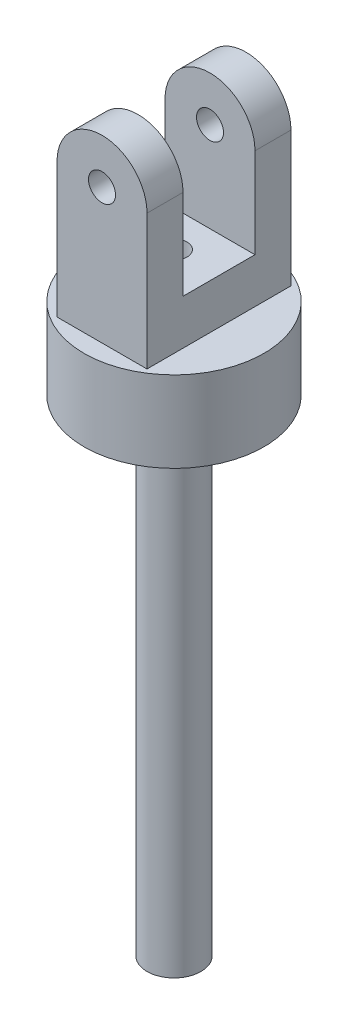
ISO-10303-21;
HEADER;
FILE_DESCRIPTION(('STEP AP214'),'2;1');
FILE_NAME('part.step','',(''),(''),'','','');
FILE_SCHEMA(('AUTOMOTIVE_DESIGN { 1 0 10303 214 1 1 1 1 }'));
ENDSEC;
DATA;
#1=APPLICATION_CONTEXT('core data for automotive mechanical design processes');
#2=APPLICATION_PROTOCOL_DEFINITION('international standard','automotive_design',2000,#1);
#3=PRODUCT_CONTEXT('',#1,'mechanical');
#4=PRODUCT('Part','Part','',(#3));
#5=PRODUCT_RELATED_PRODUCT_CATEGORY('part','',(#4));
#6=PRODUCT_DEFINITION_FORMATION('','',#4);
#7=PRODUCT_DEFINITION_CONTEXT('part definition',#1,'design');
#8=PRODUCT_DEFINITION('design','',#6,#7);
#9=PRODUCT_DEFINITION_SHAPE('','',#8);
#10=(LENGTH_UNIT() NAMED_UNIT(*) SI_UNIT(.MILLI.,.METRE.));
#11=(NAMED_UNIT(*) PLANE_ANGLE_UNIT() SI_UNIT($,.RADIAN.));
#12=(NAMED_UNIT(*) SI_UNIT($,.STERADIAN.) SOLID_ANGLE_UNIT());
#13=UNCERTAINTY_MEASURE_WITH_UNIT(LENGTH_MEASURE(1.E-05),#10,'distance_accuracy_value','');
#14=(GEOMETRIC_REPRESENTATION_CONTEXT(3) GLOBAL_UNCERTAINTY_ASSIGNED_CONTEXT((#13)) GLOBAL_UNIT_ASSIGNED_CONTEXT((#10,
#11,#12)) REPRESENTATION_CONTEXT('',''));
#15=CARTESIAN_POINT('',(0.,0.,0.));
#16=DIRECTION('',(0.,0.,1.));
#17=DIRECTION('',(1.,0.,0.));
#18=AXIS2_PLACEMENT_3D('',#15,#16,#17);
#19=CARTESIAN_POINT('',(0.,-9.,0.));
#20=DIRECTION('',(0.,-1.,0.));
#21=DIRECTION('',(0.,0.,-1.));
#22=AXIS2_PLACEMENT_3D('',#19,#20,#21);
#23=PLANE('',#22);
#24=CARTESIAN_POINT('',(-10.6521739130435,-9.,1.73913043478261));
#25=DIRECTION('',(0.,-1.,0.));
#26=DIRECTION('',(0.,0.,-1.));
#27=AXIS2_PLACEMENT_3D('',#24,#25,#26);
#28=CIRCLE('',#27,8.);
#29=CARTESIAN_POINT('',(-10.6521739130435,-9.,-6.26086956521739));
#30=VERTEX_POINT('',#29);
#31=EDGE_CURVE('E289',#30,#30,#28,.F.);
#32=ORIENTED_EDGE('',*,*,#31,.F.);
#33=EDGE_LOOP('',(#32));
#34=FACE_BOUND('',#33,.T.);
#35=CARTESIAN_POINT('',(-10.6521739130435,-9.,1.73913043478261));
#36=DIRECTION('',(0.,-1.,0.));
#37=DIRECTION('',(0.,0.,-1.));
#38=AXIS2_PLACEMENT_3D('',#35,#36,#37);
#39=CIRCLE('',#38,3.);
#40=CARTESIAN_POINT('',(-10.6521739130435,-9.,-1.26086956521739));
#41=VERTEX_POINT('',#40);
#42=EDGE_CURVE('E159',#41,#41,#39,.F.);
#43=ORIENTED_EDGE('',*,*,#42,.T.);
#44=EDGE_LOOP('',(#43));
#45=FACE_BOUND('',#44,.T.);
#46=ADVANCED_FACE('F79',(#34,#45),#23,.T.);
#47=CARTESIAN_POINT('',(0.,-68.,0.));
#48=DIRECTION('',(0.,-1.,0.));
#49=DIRECTION('',(0.,0.,-1.));
#50=AXIS2_PLACEMENT_3D('',#47,#48,#49);
#51=PLANE('',#50);
#52=CARTESIAN_POINT('',(-10.6521739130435,-68.,1.73913043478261));
#53=DIRECTION('',(0.,-1.,0.));
#54=DIRECTION('',(0.,0.,-1.));
#55=AXIS2_PLACEMENT_3D('',#52,#53,#54);
#56=CIRCLE('',#55,1.45);
#57=CARTESIAN_POINT('',(-10.6521739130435,-68.,0.289130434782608));
#58=VERTEX_POINT('',#57);
#59=EDGE_CURVE('E302',#58,#58,#56,.T.);
#60=ORIENTED_EDGE('',*,*,#59,.F.);
#61=EDGE_LOOP('',(#60));
#62=FACE_BOUND('',#61,.T.);
#63=CARTESIAN_POINT('',(-10.6521739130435,-68.,1.73913043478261));
#64=DIRECTION('',(0.,-1.,0.));
#65=DIRECTION('',(0.,0.,-1.));
#66=AXIS2_PLACEMENT_3D('',#63,#64,#65);
#67=CIRCLE('',#66,3.);
#68=CARTESIAN_POINT('',(-10.6521739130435,-68.,-1.26086956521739));
#69=VERTEX_POINT('',#68);
#70=EDGE_CURVE('E180',#69,#69,#67,.T.);
#71=ORIENTED_EDGE('',*,*,#70,.T.);
#72=EDGE_LOOP('',(#71));
#73=FACE_BOUND('',#72,.T.);
#74=ADVANCED_FACE('F263',(#62,#73),#51,.T.);
#75=CARTESIAN_POINT('',(-10.6521739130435,-68.,1.73913043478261));
#76=DIRECTION('',(0.,1.,0.));
#77=DIRECTION('',(0.,0.,1.));
#78=AXIS2_PLACEMENT_3D('',#75,#76,#77);
#79=CYLINDRICAL_SURFACE('',#78,3.);
#80=ORIENTED_EDGE('',*,*,#42,.F.);
#81=EDGE_LOOP('',(#80));
#82=FACE_BOUND('',#81,.T.);
#83=ORIENTED_EDGE('',*,*,#70,.F.);
#84=EDGE_LOOP('',(#83));
#85=FACE_BOUND('',#84,.T.);
#86=ADVANCED_FACE('F269',(#82,#85),#79,.T.);
#87=CARTESIAN_POINT('',(-10.6521739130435,-14.,1.73913043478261));
#88=DIRECTION('',(0.,1.,0.));
#89=DIRECTION('',(0.,0.,1.));
#90=AXIS2_PLACEMENT_3D('',#87,#88,#89);
#91=CYLINDRICAL_SURFACE('',#90,8.);
#92=ORIENTED_EDGE('',*,*,#31,.T.);
#93=EDGE_LOOP('',(#92));
#94=FACE_BOUND('',#93,.T.);
#95=CARTESIAN_POINT('',(-10.6521739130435,-14.,1.73913043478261));
#96=DIRECTION('',(0.,-1.,0.));
#97=DIRECTION('',(0.,0.,-1.));
#98=AXIS2_PLACEMENT_3D('',#95,#96,#97);
#99=CIRCLE('',#98,8.);
#100=CARTESIAN_POINT('',(-10.6521739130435,-14.,-6.26086956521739));
#101=VERTEX_POINT('',#100);
#102=EDGE_CURVE('E297',#101,#101,#99,.T.);
#103=ORIENTED_EDGE('',*,*,#102,.T.);
#104=EDGE_LOOP('',(#103));
#105=FACE_BOUND('',#104,.T.);
#106=ADVANCED_FACE('F275',(#94,#105),#91,.F.);
#107=CARTESIAN_POINT('',(-10.6521739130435,-14.,1.73913043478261));
#108=DIRECTION('',(0.,1.,0.));
#109=DIRECTION('',(0.,0.,1.));
#110=AXIS2_PLACEMENT_3D('',#107,#108,#109);
#111=CYLINDRICAL_SURFACE('',#110,10.);
#112=CARTESIAN_POINT('',(-10.6521739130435,-14.,1.73913043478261));
#113=DIRECTION('',(0.,-1.,0.));
#114=DIRECTION('',(0.,0.,-1.));
#115=AXIS2_PLACEMENT_3D('',#112,#113,#114);
#116=CIRCLE('',#115,10.);
#117=CARTESIAN_POINT('',(-10.6521739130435,-14.,-8.26086956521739));
#118=VERTEX_POINT('',#117);
#119=EDGE_CURVE('E291',#118,#118,#116,.T.);
#120=ORIENTED_EDGE('',*,*,#119,.F.);
#121=EDGE_LOOP('',(#120));
#122=FACE_BOUND('',#121,.T.);
#123=CARTESIAN_POINT('',(-10.6521739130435,-5.,1.73913043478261));
#124=DIRECTION('',(0.,-1.,0.));
#125=DIRECTION('',(0.,0.,-1.));
#126=AXIS2_PLACEMENT_3D('',#123,#124,#125);
#127=CIRCLE('',#126,10.);
#128=CARTESIAN_POINT('',(-10.6521739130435,-5.,-8.26086956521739));
#129=VERTEX_POINT('',#128);
#130=EDGE_CURVE('E294',#129,#129,#127,.T.);
#131=ORIENTED_EDGE('',*,*,#130,.T.);
#132=EDGE_LOOP('',(#131));
#133=FACE_BOUND('',#132,.T.);
#134=ADVANCED_FACE('F282',(#122,#133),#111,.T.);
#135=CARTESIAN_POINT('',(0.,-14.,0.));
#136=DIRECTION('',(0.,-1.,0.));
#137=DIRECTION('',(0.,0.,-1.));
#138=AXIS2_PLACEMENT_3D('',#135,#136,#137);
#139=PLANE('',#138);
#140=ORIENTED_EDGE('',*,*,#102,.F.);
#141=EDGE_LOOP('',(#140));
#142=FACE_BOUND('',#141,.T.);
#143=ORIENTED_EDGE('',*,*,#119,.T.);
#144=EDGE_LOOP('',(#143));
#145=FACE_BOUND('',#144,.T.);
#146=ADVANCED_FACE('F334',(#142,#145),#139,.T.);
#147=CARTESIAN_POINT('',(-10.6521739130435,10.,-13.3319373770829));
#148=DIRECTION('',(0.,0.,1.));
#149=DIRECTION('',(1.,0.,0.));
#150=AXIS2_PLACEMENT_3D('',#147,#148,#149);
#151=CYLINDRICAL_SURFACE('',#150,1.5);
#152=CARTESIAN_POINT('',(-10.6521739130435,10.,-6.26086956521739));
#153=DIRECTION('',(0.,0.,-1.));
#154=DIRECTION('',(-1.,0.,0.));
#155=AXIS2_PLACEMENT_3D('',#152,#153,#154);
#156=CIRCLE('',#155,1.5);
#157=CARTESIAN_POINT('',(-12.1521739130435,10.,-6.26086956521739));
#158=VERTEX_POINT('',#157);
#159=EDGE_CURVE('E195',#158,#158,#156,.F.);
#160=ORIENTED_EDGE('',*,*,#159,.F.);
#161=EDGE_LOOP('',(#160));
#162=FACE_BOUND('',#161,.T.);
#163=CARTESIAN_POINT('',(-10.6521739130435,10.,-2.26086956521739));
#164=DIRECTION('',(0.,0.,-1.));
#165=DIRECTION('',(-1.,0.,0.));
#166=AXIS2_PLACEMENT_3D('',#163,#164,#165);
#167=CIRCLE('',#166,1.5);
#168=CARTESIAN_POINT('',(-12.1521739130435,10.,-2.26086956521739));
#169=VERTEX_POINT('',#168);
#170=EDGE_CURVE('E203',#169,#169,#167,.T.);
#171=ORIENTED_EDGE('',*,*,#170,.F.);
#172=EDGE_LOOP('',(#171));
#173=FACE_BOUND('',#172,.T.);
#174=ADVANCED_FACE('F331',(#162,#173),#151,.F.);
#175=CARTESIAN_POINT('',(-10.6521739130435,10.,5.73913043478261));
#176=DIRECTION('',(0.,0.,-1.));
#177=DIRECTION('',(-1.,0.,0.));
#178=AXIS2_PLACEMENT_3D('',#175,#176,#177);
#179=CIRCLE('',#178,1.5);
#180=CARTESIAN_POINT('',(-12.1521739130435,10.,5.73913043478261));
#181=VERTEX_POINT('',#180);
#182=EDGE_CURVE('E202',#181,#181,#179,.T.);
#183=ORIENTED_EDGE('',*,*,#182,.T.);
#184=EDGE_LOOP('',(#183));
#185=FACE_BOUND('',#184,.T.);
#186=CARTESIAN_POINT('',(-10.6521739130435,10.,9.73913043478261));
#187=DIRECTION('',(0.,0.,1.));
#188=DIRECTION('',(1.,0.,0.));
#189=AXIS2_PLACEMENT_3D('',#186,#187,#188);
#190=CIRCLE('',#189,1.5);
#191=CARTESIAN_POINT('',(-9.15217391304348,10.,9.73913043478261));
#192=VERTEX_POINT('',#191);
#193=EDGE_CURVE('E188',#192,#192,#190,.T.);
#194=ORIENTED_EDGE('',*,*,#193,.T.);
#195=EDGE_LOOP('',(#194));
#196=FACE_BOUND('',#195,.T.);
#197=ADVANCED_FACE('F228',(#185,#196),#151,.F.);
#198=CARTESIAN_POINT('',(0.,15.,-2.26086956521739));
#199=DIRECTION('',(0.,0.,-1.));
#200=DIRECTION('',(-1.,0.,0.));
#201=AXIS2_PLACEMENT_3D('',#198,#199,#200);
#202=PLANE('',#201);
#203=ORIENTED_EDGE('',*,*,#170,.T.);
#204=EDGE_LOOP('',(#203));
#205=FACE_BOUND('',#204,.T.);
#206=DIRECTION('',(0.,-1.,0.));
#207=VECTOR('',#206,1.);
#208=CARTESIAN_POINT('',(-5.65217391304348,15.,-2.26086956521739));
#209=LINE('',#208,#207);
#210=CARTESIAN_POINT('',(-5.65217391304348,10.,-2.26086956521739));
#211=VERTEX_POINT('',#210);
#212=CARTESIAN_POINT('',(-5.65217391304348,0.,-2.26086956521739));
#213=VERTEX_POINT('',#212);
#214=EDGE_CURVE('E218',#211,#213,#209,.T.);
#215=ORIENTED_EDGE('',*,*,#214,.F.);
#216=CARTESIAN_POINT('',(-10.6521739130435,10.,-2.26086956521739));
#217=DIRECTION('',(0.,0.,-1.));
#218=DIRECTION('',(-1.,0.,0.));
#219=AXIS2_PLACEMENT_3D('',#216,#217,#218);
#220=CIRCLE('',#219,5.);
#221=CARTESIAN_POINT('',(-15.6521739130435,10.,-2.26086956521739));
#222=VERTEX_POINT('',#221);
#223=EDGE_CURVE('E200',#222,#211,#220,.T.);
#224=ORIENTED_EDGE('',*,*,#223,.F.);
#225=DIRECTION('',(0.,-1.,0.));
#226=VECTOR('',#225,1.);
#227=CARTESIAN_POINT('',(-15.6521739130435,15.,-2.26086956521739));
#228=LINE('',#227,#226);
#229=CARTESIAN_POINT('',(-15.6521739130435,0.,-2.26086956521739));
#230=VERTEX_POINT('',#229);
#231=EDGE_CURVE('E220',#222,#230,#228,.T.);
#232=ORIENTED_EDGE('',*,*,#231,.T.);
#233=DIRECTION('',(1.,0.,0.));
#234=VECTOR('',#233,1.);
#235=CARTESIAN_POINT('',(0.,0.,-2.26086956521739));
#236=LINE('',#235,#234);
#237=EDGE_CURVE('E214',#230,#213,#236,.T.);
#238=ORIENTED_EDGE('',*,*,#237,.T.);
#239=EDGE_LOOP('',(#215,#224,#232,#238));
#240=FACE_BOUND('',#239,.T.);
#241=ADVANCED_FACE('F245',(#205,#240),#202,.F.);
#242=CARTESIAN_POINT('',(0.,0.,0.));
#243=DIRECTION('',(0.,1.,0.));
#244=DIRECTION('',(0.,0.,1.));
#245=AXIS2_PLACEMENT_3D('',#242,#243,#244);
#246=PLANE('',#245);
#247=CARTESIAN_POINT('',(-10.6521739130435,0.,1.73913043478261));
#248=DIRECTION('',(0.,1.,0.));
#249=DIRECTION('',(0.,0.,1.));
#250=AXIS2_PLACEMENT_3D('',#247,#248,#249);
#251=CIRCLE('',#250,1.45);
#252=CARTESIAN_POINT('',(-10.6521739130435,0.,3.18913043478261));
#253=VERTEX_POINT('',#252);
#254=EDGE_CURVE('E83',#253,#253,#251,.T.);
#255=ORIENTED_EDGE('',*,*,#254,.F.);
#256=EDGE_LOOP('',(#255));
#257=FACE_BOUND('',#256,.T.);
#258=DIRECTION('',(1.,0.,0.));
#259=VECTOR('',#258,1.);
#260=CARTESIAN_POINT('',(0.,0.,5.73913043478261));
#261=LINE('',#260,#259);
#262=CARTESIAN_POINT('',(-15.6521739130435,0.,5.73913043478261));
#263=VERTEX_POINT('',#262);
#264=CARTESIAN_POINT('',(-5.65217391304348,0.,5.73913043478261));
#265=VERTEX_POINT('',#264);
#266=EDGE_CURVE('E206',#263,#265,#261,.T.);
#267=ORIENTED_EDGE('',*,*,#266,.T.);
#268=DIRECTION('',(0.,0.,1.));
#269=VECTOR('',#268,1.);
#270=CARTESIAN_POINT('',(-5.65217391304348,0.,0.));
#271=LINE('',#270,#269);
#272=EDGE_CURVE('E167',#213,#265,#271,.T.);
#273=ORIENTED_EDGE('',*,*,#272,.F.);
#274=ORIENTED_EDGE('',*,*,#237,.F.);
#275=DIRECTION('',(0.,0.,1.));
#276=VECTOR('',#275,1.);
#277=CARTESIAN_POINT('',(-15.6521739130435,0.,0.));
#278=LINE('',#277,#276);
#279=EDGE_CURVE('E210',#230,#263,#278,.T.);
#280=ORIENTED_EDGE('',*,*,#279,.T.);
#281=EDGE_LOOP('',(#267,#273,#274,#280));
#282=FACE_BOUND('',#281,.T.);
#283=ADVANCED_FACE('F234',(#257,#282),#246,.T.);
#284=CARTESIAN_POINT('',(0.,15.,5.73913043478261));
#285=DIRECTION('',(0.,0.,-1.));
#286=DIRECTION('',(-1.,0.,0.));
#287=AXIS2_PLACEMENT_3D('',#284,#285,#286);
#288=PLANE('',#287);
#289=ORIENTED_EDGE('',*,*,#182,.F.);
#290=EDGE_LOOP('',(#289));
#291=FACE_BOUND('',#290,.T.);
#292=CARTESIAN_POINT('',(-10.6521739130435,10.,5.73913043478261));
#293=DIRECTION('',(0.,0.,-1.));
#294=DIRECTION('',(-1.,0.,0.));
#295=AXIS2_PLACEMENT_3D('',#292,#293,#294);
#296=CIRCLE('',#295,5.);
#297=CARTESIAN_POINT('',(-15.6521739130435,10.,5.73913043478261));
#298=VERTEX_POINT('',#297);
#299=CARTESIAN_POINT('',(-5.65217391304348,10.,5.73913043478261));
#300=VERTEX_POINT('',#299);
#301=EDGE_CURVE('E198',#298,#300,#296,.T.);
#302=ORIENTED_EDGE('',*,*,#301,.T.);
#303=DIRECTION('',(0.,-1.,0.));
#304=VECTOR('',#303,1.);
#305=CARTESIAN_POINT('',(-5.65217391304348,15.,5.73913043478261));
#306=LINE('',#305,#304);
#307=EDGE_CURVE('E95',#300,#265,#306,.T.);
#308=ORIENTED_EDGE('',*,*,#307,.T.);
#309=ORIENTED_EDGE('',*,*,#266,.F.);
#310=DIRECTION('',(0.,-1.,0.));
#311=VECTOR('',#310,1.);
#312=CARTESIAN_POINT('',(-15.6521739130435,15.,5.73913043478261));
#313=LINE('',#312,#311);
#314=EDGE_CURVE('E103',#298,#263,#313,.T.);
#315=ORIENTED_EDGE('',*,*,#314,.F.);
#316=EDGE_LOOP('',(#302,#308,#309,#315));
#317=FACE_BOUND('',#316,.T.);
#318=ADVANCED_FACE('F231',(#291,#317),#288,.T.);
#319=CARTESIAN_POINT('',(-10.6521739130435,10.,-13.3319373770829));
#320=DIRECTION('',(0.,0.,1.));
#321=DIRECTION('',(1.,0.,0.));
#322=AXIS2_PLACEMENT_3D('',#319,#320,#321);
#323=CYLINDRICAL_SURFACE('',#322,5.);
#324=DIRECTION('',(0.,0.,1.));
#325=VECTOR('',#324,1.);
#326=CARTESIAN_POINT('',(-15.6521739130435,10.,-13.3319373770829));
#327=LINE('',#326,#325);
#328=CARTESIAN_POINT('',(-15.6521739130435,10.,9.73913043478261));
#329=VERTEX_POINT('',#328);
#330=EDGE_CURVE('E191',#298,#329,#327,.T.);
#331=ORIENTED_EDGE('',*,*,#330,.T.);
#332=CARTESIAN_POINT('',(-10.6521739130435,10.,9.73913043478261));
#333=DIRECTION('',(0.,0.,1.));
#334=DIRECTION('',(1.,0.,0.));
#335=AXIS2_PLACEMENT_3D('',#332,#333,#334);
#336=CIRCLE('',#335,5.);
#337=CARTESIAN_POINT('',(-5.65217391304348,10.,9.73913043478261));
#338=VERTEX_POINT('',#337);
#339=EDGE_CURVE('E165',#338,#329,#336,.T.);
#340=ORIENTED_EDGE('',*,*,#339,.F.);
#341=DIRECTION('',(0.,0.,1.));
#342=VECTOR('',#341,1.);
#343=CARTESIAN_POINT('',(-5.65217391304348,10.,-13.3319373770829));
#344=LINE('',#343,#342);
#345=EDGE_CURVE('E12',#300,#338,#344,.T.);
#346=ORIENTED_EDGE('',*,*,#345,.F.);
#347=ORIENTED_EDGE('',*,*,#301,.F.);
#348=EDGE_LOOP('',(#331,#340,#346,#347));
#349=FACE_BOUND('',#348,.T.);
#350=ADVANCED_FACE('F233',(#349),#323,.T.);
#351=ORIENTED_EDGE('',*,*,#223,.T.);
#352=DIRECTION('',(0.,0.,1.));
#353=VECTOR('',#352,1.);
#354=CARTESIAN_POINT('',(-5.65217391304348,10.,-13.3319373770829));
#355=LINE('',#354,#353);
#356=CARTESIAN_POINT('',(-5.65217391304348,10.,-6.26086956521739));
#357=VERTEX_POINT('',#356);
#358=EDGE_CURVE('E183',#357,#211,#355,.T.);
#359=ORIENTED_EDGE('',*,*,#358,.F.);
#360=CARTESIAN_POINT('',(-10.6521739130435,10.,-6.26086956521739));
#361=DIRECTION('',(0.,0.,-1.));
#362=DIRECTION('',(-1.,0.,0.));
#363=AXIS2_PLACEMENT_3D('',#360,#361,#362);
#364=CIRCLE('',#363,5.);
#365=CARTESIAN_POINT('',(-15.6521739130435,10.,-6.26086956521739));
#366=VERTEX_POINT('',#365);
#367=EDGE_CURVE('E186',#357,#366,#364,.F.);
#368=ORIENTED_EDGE('',*,*,#367,.T.);
#369=EDGE_CURVE('E189',#366,#222,#327,.T.);
#370=ORIENTED_EDGE('',*,*,#369,.T.);
#371=EDGE_LOOP('',(#351,#359,#368,#370));
#372=FACE_BOUND('',#371,.T.);
#373=ADVANCED_FACE('F252',(#372),#323,.T.);
#374=CARTESIAN_POINT('',(0.,-5.,0.));
#375=DIRECTION('',(0.,-1.,0.));
#376=DIRECTION('',(0.,0.,-1.));
#377=AXIS2_PLACEMENT_3D('',#374,#375,#376);
#378=PLANE('',#377);
#379=DIRECTION('',(0.,0.,-1.));
#380=VECTOR('',#379,1.);
#381=CARTESIAN_POINT('',(-15.6521739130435,-5.,9.73913043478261));
#382=LINE('',#381,#380);
#383=CARTESIAN_POINT('',(-15.6521739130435,-5.,9.73913043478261));
#384=VERTEX_POINT('',#383);
#385=CARTESIAN_POINT('',(-15.6521739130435,-5.,-6.26086956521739));
#386=VERTEX_POINT('',#385);
#387=EDGE_CURVE('E152',#384,#386,#382,.T.);
#388=ORIENTED_EDGE('',*,*,#387,.T.);
#389=DIRECTION('',(1.,0.,0.));
#390=VECTOR('',#389,1.);
#391=CARTESIAN_POINT('',(-15.6521739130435,-5.,-6.26086956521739));
#392=LINE('',#391,#390);
#393=CARTESIAN_POINT('',(-5.65217391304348,-5.,-6.26086956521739));
#394=VERTEX_POINT('',#393);
#395=EDGE_CURVE('E174',#386,#394,#392,.T.);
#396=ORIENTED_EDGE('',*,*,#395,.T.);
#397=DIRECTION('',(0.,0.,1.));
#398=VECTOR('',#397,1.);
#399=CARTESIAN_POINT('',(-5.65217391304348,-5.,-6.26086956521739));
#400=LINE('',#399,#398);
#401=CARTESIAN_POINT('',(-5.65217391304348,-5.,9.73913043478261));
#402=VERTEX_POINT('',#401);
#403=EDGE_CURVE('E155',#394,#402,#400,.T.);
#404=ORIENTED_EDGE('',*,*,#403,.T.);
#405=DIRECTION('',(-1.,0.,0.));
#406=VECTOR('',#405,1.);
#407=CARTESIAN_POINT('',(-5.65217391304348,-5.,9.73913043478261));
#408=LINE('',#407,#406);
#409=EDGE_CURVE('E147',#402,#384,#408,.T.);
#410=ORIENTED_EDGE('',*,*,#409,.T.);
#411=EDGE_LOOP('',(#388,#396,#404,#410));
#412=FACE_BOUND('',#411,.T.);
#413=ORIENTED_EDGE('',*,*,#130,.F.);
#414=EDGE_LOOP('',(#413));
#415=FACE_BOUND('',#414,.T.);
#416=ADVANCED_FACE('F149',(#412,#415),#378,.F.);
#417=CARTESIAN_POINT('',(-15.6521739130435,15.,0.));
#418=DIRECTION('',(1.,0.,0.));
#419=DIRECTION('',(0.,0.,-1.));
#420=AXIS2_PLACEMENT_3D('',#417,#418,#419);
#421=PLANE('',#420);
#422=ORIENTED_EDGE('',*,*,#369,.F.);
#423=DIRECTION('',(0.,-1.,0.));
#424=VECTOR('',#423,1.);
#425=CARTESIAN_POINT('',(-15.6521739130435,15.,-6.26086956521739));
#426=LINE('',#425,#424);
#427=EDGE_CURVE('E172',#366,#386,#426,.T.);
#428=ORIENTED_EDGE('',*,*,#427,.T.);
#429=ORIENTED_EDGE('',*,*,#387,.F.);
#430=DIRECTION('',(0.,1.,0.));
#431=VECTOR('',#430,1.);
#432=CARTESIAN_POINT('',(-15.6521739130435,-4.,9.73913043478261));
#433=LINE('',#432,#431);
#434=EDGE_CURVE('E163',#384,#329,#433,.T.);
#435=ORIENTED_EDGE('',*,*,#434,.T.);
#436=ORIENTED_EDGE('',*,*,#330,.F.);
#437=ORIENTED_EDGE('',*,*,#314,.T.);
#438=ORIENTED_EDGE('',*,*,#279,.F.);
#439=ORIENTED_EDGE('',*,*,#231,.F.);
#440=EDGE_LOOP('',(#422,#428,#429,#435,#436,#437,#438,#439));
#441=FACE_BOUND('',#440,.T.);
#442=ADVANCED_FACE('F170',(#441),#421,.F.);
#443=CARTESIAN_POINT('',(-5.65217391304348,15.,0.));
#444=DIRECTION('',(1.,0.,0.));
#445=DIRECTION('',(0.,0.,-1.));
#446=AXIS2_PLACEMENT_3D('',#443,#444,#445);
#447=PLANE('',#446);
#448=DIRECTION('',(0.,-1.,0.));
#449=VECTOR('',#448,1.);
#450=CARTESIAN_POINT('',(-5.65217391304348,15.,-6.26086956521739));
#451=LINE('',#450,#449);
#452=EDGE_CURVE('E88',#357,#394,#451,.T.);
#453=ORIENTED_EDGE('',*,*,#452,.F.);
#454=ORIENTED_EDGE('',*,*,#358,.T.);
#455=ORIENTED_EDGE('',*,*,#214,.T.);
#456=ORIENTED_EDGE('',*,*,#272,.T.);
#457=ORIENTED_EDGE('',*,*,#307,.F.);
#458=ORIENTED_EDGE('',*,*,#345,.T.);
#459=DIRECTION('',(0.,1.,0.));
#460=VECTOR('',#459,1.);
#461=CARTESIAN_POINT('',(-5.65217391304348,-4.,9.73913043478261));
#462=LINE('',#461,#460);
#463=EDGE_CURVE('E166',#402,#338,#462,.T.);
#464=ORIENTED_EDGE('',*,*,#463,.F.);
#465=ORIENTED_EDGE('',*,*,#403,.F.);
#466=EDGE_LOOP('',(#453,#454,#455,#456,#457,#458,#464,#465));
#467=FACE_BOUND('',#466,.T.);
#468=ADVANCED_FACE('F81',(#467),#447,.T.);
#469=CARTESIAN_POINT('',(0.,-4.,9.73913043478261));
#470=DIRECTION('',(0.,0.,1.));
#471=DIRECTION('',(1.,0.,0.));
#472=AXIS2_PLACEMENT_3D('',#469,#470,#471);
#473=PLANE('',#472);
#474=ORIENTED_EDGE('',*,*,#193,.F.);
#475=EDGE_LOOP('',(#474));
#476=FACE_BOUND('',#475,.T.);
#477=ORIENTED_EDGE('',*,*,#463,.T.);
#478=ORIENTED_EDGE('',*,*,#339,.T.);
#479=ORIENTED_EDGE('',*,*,#434,.F.);
#480=ORIENTED_EDGE('',*,*,#409,.F.);
#481=EDGE_LOOP('',(#477,#478,#479,#480));
#482=FACE_BOUND('',#481,.T.);
#483=ADVANCED_FACE('F164',(#476,#482),#473,.T.);
#484=CARTESIAN_POINT('',(0.,15.,-6.26086956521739));
#485=DIRECTION('',(0.,0.,-1.));
#486=DIRECTION('',(-1.,0.,0.));
#487=AXIS2_PLACEMENT_3D('',#484,#485,#486);
#488=PLANE('',#487);
#489=ORIENTED_EDGE('',*,*,#159,.T.);
#490=EDGE_LOOP('',(#489));
#491=FACE_BOUND('',#490,.T.);
#492=ORIENTED_EDGE('',*,*,#367,.F.);
#493=ORIENTED_EDGE('',*,*,#452,.T.);
#494=ORIENTED_EDGE('',*,*,#395,.F.);
#495=ORIENTED_EDGE('',*,*,#427,.F.);
#496=EDGE_LOOP('',(#492,#493,#494,#495));
#497=FACE_BOUND('',#496,.T.);
#498=ADVANCED_FACE('F250',(#491,#497),#488,.T.);
#499=CARTESIAN_POINT('',(-10.6521739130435,15.,1.73913043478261));
#500=DIRECTION('',(0.,-1.,0.));
#501=DIRECTION('',(0.,0.,-1.));
#502=AXIS2_PLACEMENT_3D('',#499,#500,#501);
#503=CYLINDRICAL_SURFACE('',#502,1.45);
#504=ORIENTED_EDGE('',*,*,#254,.T.);
#505=EDGE_LOOP('',(#504));
#506=FACE_BOUND('',#505,.T.);
#507=ORIENTED_EDGE('',*,*,#59,.T.);
#508=EDGE_LOOP('',(#507));
#509=FACE_BOUND('',#508,.T.);
#510=ADVANCED_FACE('F309',(#506,#509),#503,.F.);
#511=CLOSED_SHELL('',(#46,#74,#86,#106,#134,#146,#174,#197,#241,#283,#318,#350,#373,#416,#442,
#468,#483,#498,#510));
#512=MANIFOLD_SOLID_BREP('B2',#511);
#513=ADVANCED_BREP_SHAPE_REPRESENTATION('',(#18,#512),#14);
#514=SHAPE_DEFINITION_REPRESENTATION(#9,#513);
ENDSEC;
END-ISO-10303-21;
